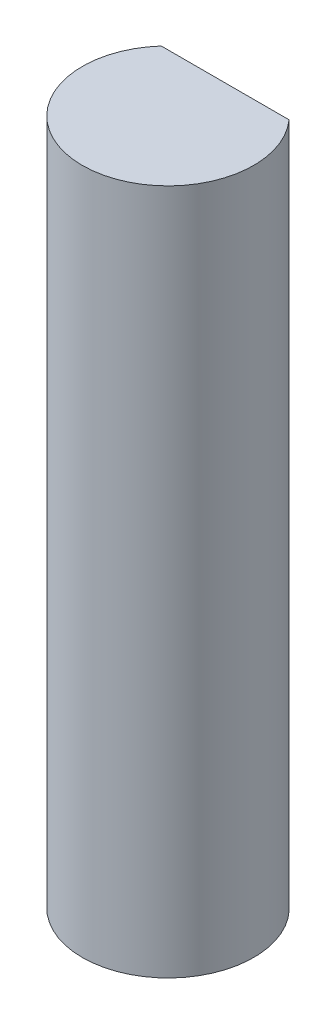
from build123d import *

# Parameters (mm, degrees)
SKETCH_1_R          = 1.5
EXTRUDE_1_DEPTH     = 10
CUT_EXTRUDE_START   = -10
CUT_EXTRUDE_1_DEPTH = 10
BOSS_EXTRUDE1_START = 2
SKETCH1_R           = 1.5
BOSS_EXTRUDE1_DEPTH = 2


with BuildPart() as part:
    # Sketch 1 → Extrude 1 (new body)
    with BuildSketch(Plane(origin=(0, 0, 0), x_dir=(1, 0, 0), z_dir=(0, 1, 0))):
        with Locations(Location((0, 0, 0), (0, 0, 270))):
            Circle(SKETCH_1_R)
    extrude(amount=EXTRUDE_1_DEPTH)

    # Sketch 2 → Cut-Extrude 1 (cut)
    with BuildSketch(Plane(origin=(0, 10, 0), x_dir=(1, 0, 0), z_dir=(0, 1, 0)).offset(CUT_EXTRUDE_START)):
        with BuildLine():
            Line((-1.118033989, 1), (1.118033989, 1))
            ThreePointArc((1.118033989, 1), (0, 1.5), (-1.118033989, 1))
        make_face()
    extrude(amount=CUT_EXTRUDE_1_DEPTH, mode=Mode.SUBTRACT)

    # Sketch1 → Boss-Extrude1 (add)
    with BuildSketch(Plane.XZ.offset(BOSS_EXTRUDE1_START)):
        with Locations(Location((0, 0, 0), (0, 0, 270))):
            Circle(SKETCH1_R)
    extrude(amount=-BOSS_EXTRUDE1_DEPTH)


solid = part.part
